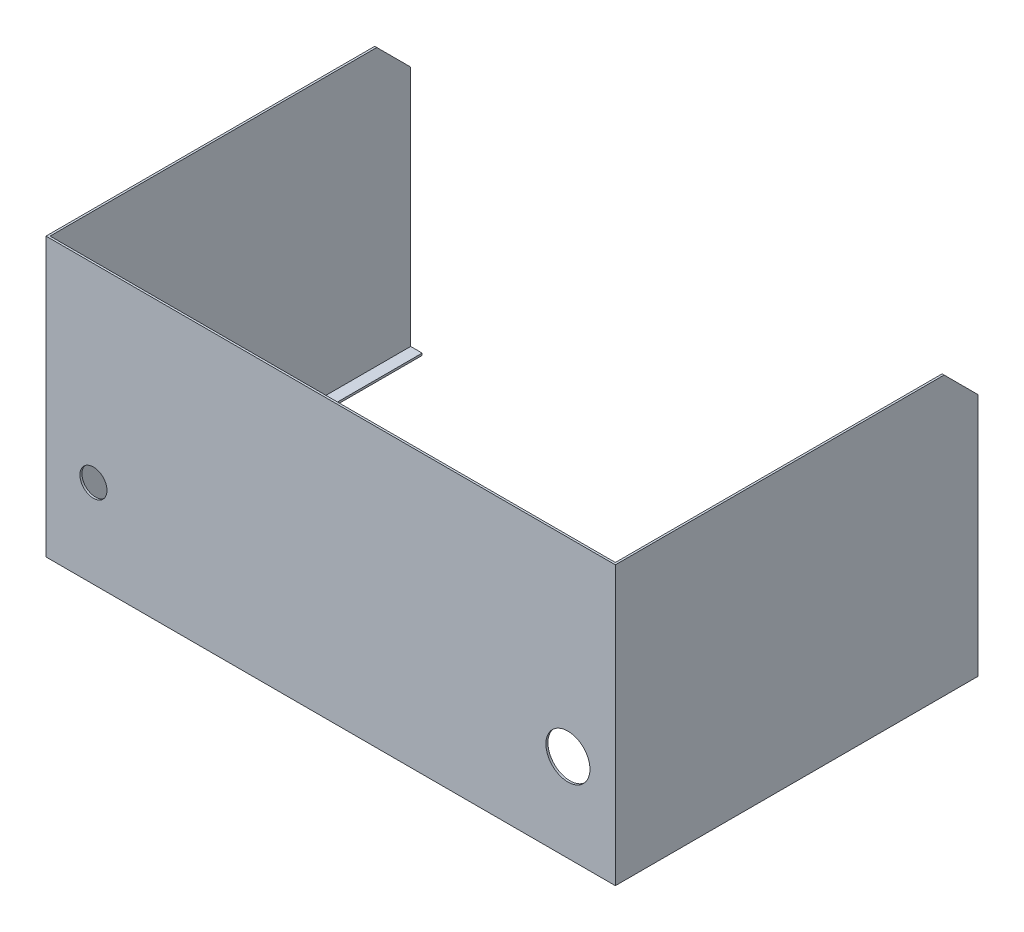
from build123d import *

# Parameters (mm, degrees)
SKETCH_1_W      = 840
SKETCH_1_H      = 410
SKETCH_1_R      = 20
SKETCH_1_R_2    = 32.5
EXTRUDE_1_DEPTH = 3
EXTRUDE_2_DEPTH = 3
EXTRUDE_3_DEPTH = 3
EXTRUDE_4_DEPTH = 3


with BuildPart() as part:
    # Sketch 1 → Extrude 1 (new body)
    with BuildSketch(Plane.XY):
        Rectangle(SKETCH_1_W, SKETCH_1_H)
        with Locations((-350, -75)):
            Circle(SKETCH_1_R, mode=Mode.SUBTRACT)
        with Locations((350, -75)):
            Circle(SKETCH_1_R_2, mode=Mode.SUBTRACT)
    extrude(amount=EXTRUDE_1_DEPTH)

    # Sketch 3 → Extrude 3 (add)
    with BuildSketch(Plane.ZY.offset(420)):
        Polygon((-532, -205), (0, -205), (0, 205), (-482, 205), (-532, 155), align=None)
    extrude(amount=-EXTRUDE_3_DEPTH)



with BuildPart() as body_2:
    # Sketch 2 → Extrude 2 (new body)
    with BuildSketch(Plane(origin=(420, 0, 0), x_dir=(0, 0, -1), z_dir=(1, 0, 0))):
        Polygon((0, -205), (0, 205), (482, 205), (532, 155), (532, -205), align=None)
    extrude(amount=-EXTRUDE_2_DEPTH)


with BuildPart() as part_1:
    add(part.part)

    add(body_2.part)  # Extrude 4 merges body 2
    # Sketch 4 → Extrude 4 (add)
    with BuildSketch(Plane.XZ.offset(205)):
        Polygon((417, -532), (417, 0), (-417, 0), (-417, -532), (-400, -532), (-400, -17), (400, -17), (400, -532), align=None)
    extrude(amount=-EXTRUDE_4_DEPTH)


solid = part_1.part
